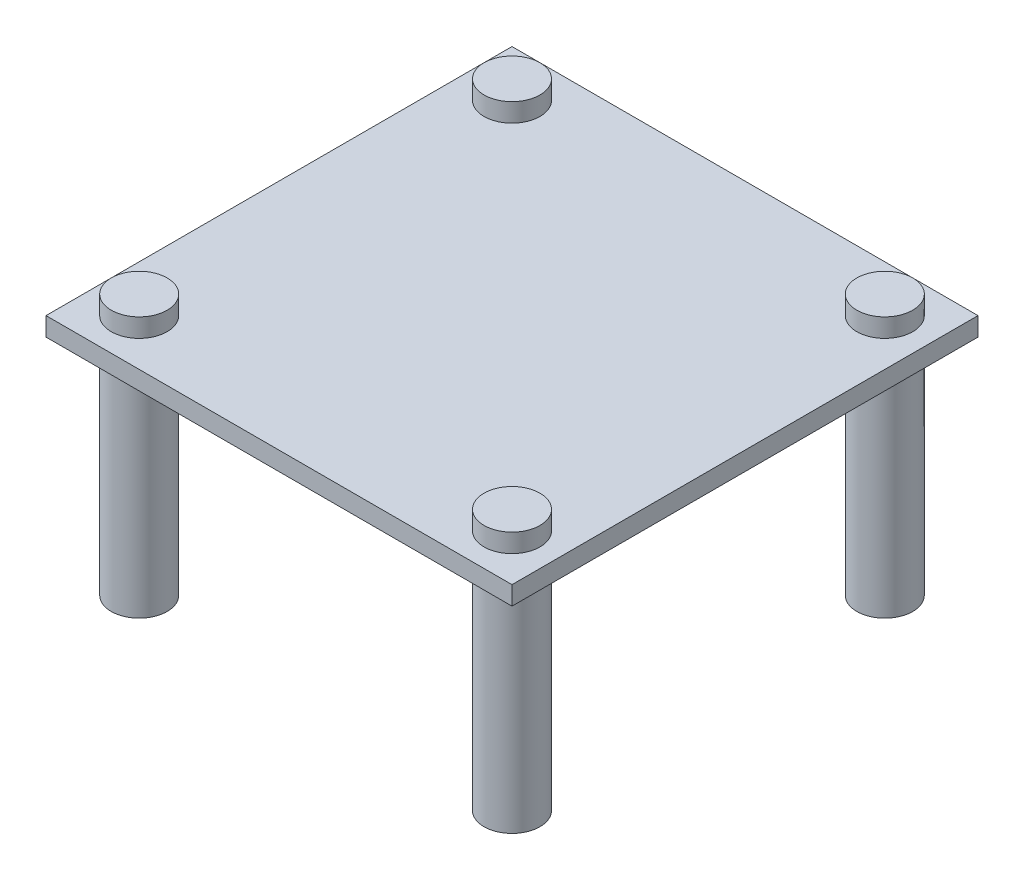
ISO-10303-21;
HEADER;
FILE_DESCRIPTION(('STEP AP214'),'2;1');
FILE_NAME('part.step','',(''),(''),'','','');
FILE_SCHEMA(('AUTOMOTIVE_DESIGN { 1 0 10303 214 1 1 1 1 }'));
ENDSEC;
DATA;
#1=APPLICATION_CONTEXT('core data for automotive mechanical design processes');
#2=APPLICATION_PROTOCOL_DEFINITION('international standard','automotive_design',2000,#1);
#3=PRODUCT_CONTEXT('',#1,'mechanical');
#4=PRODUCT('Part','Part','',(#3));
#5=PRODUCT_RELATED_PRODUCT_CATEGORY('part','',(#4));
#6=PRODUCT_DEFINITION_FORMATION('','',#4);
#7=PRODUCT_DEFINITION_CONTEXT('part definition',#1,'design');
#8=PRODUCT_DEFINITION('design','',#6,#7);
#9=PRODUCT_DEFINITION_SHAPE('','',#8);
#10=(LENGTH_UNIT() NAMED_UNIT(*) SI_UNIT(.MILLI.,.METRE.));
#11=(NAMED_UNIT(*) PLANE_ANGLE_UNIT() SI_UNIT($,.RADIAN.));
#12=(NAMED_UNIT(*) SI_UNIT($,.STERADIAN.) SOLID_ANGLE_UNIT());
#13=UNCERTAINTY_MEASURE_WITH_UNIT(LENGTH_MEASURE(1.E-05),#10,'distance_accuracy_value','');
#14=(GEOMETRIC_REPRESENTATION_CONTEXT(3) GLOBAL_UNCERTAINTY_ASSIGNED_CONTEXT((#13)) GLOBAL_UNIT_ASSIGNED_CONTEXT((#10,
#11,#12)) REPRESENTATION_CONTEXT('',''));
#15=CARTESIAN_POINT('',(0.,0.,0.));
#16=DIRECTION('',(0.,0.,1.));
#17=DIRECTION('',(1.,0.,0.));
#18=AXIS2_PLACEMENT_3D('',#15,#16,#17);
#19=CARTESIAN_POINT('',(0.,0.,0.));
#20=DIRECTION('',(0.,-1.,0.));
#21=DIRECTION('',(0.,0.,-1.));
#22=AXIS2_PLACEMENT_3D('',#19,#20,#21);
#23=PLANE('',#22);
#24=CARTESIAN_POINT('',(25.,0.,-25.));
#25=DIRECTION('',(0.,-1.,0.));
#26=DIRECTION('',(0.,0.,-1.));
#27=AXIS2_PLACEMENT_3D('',#24,#25,#26);
#28=CIRCLE('',#27,15.);
#29=CARTESIAN_POINT('',(25.,0.,-40.));
#30=VERTEX_POINT('',#29);
#31=EDGE_CURVE('E142',#30,#30,#28,.T.);
#32=ORIENTED_EDGE('',*,*,#31,.F.);
#33=EDGE_LOOP('',(#32));
#34=FACE_BOUND('',#33,.T.);
#35=CARTESIAN_POINT('',(25.,0.,-225.));
#36=DIRECTION('',(0.,-1.,0.));
#37=DIRECTION('',(0.,0.,-1.));
#38=AXIS2_PLACEMENT_3D('',#35,#36,#37);
#39=CIRCLE('',#38,15.);
#40=CARTESIAN_POINT('',(25.,0.,-240.));
#41=VERTEX_POINT('',#40);
#42=EDGE_CURVE('E154',#41,#41,#39,.T.);
#43=ORIENTED_EDGE('',*,*,#42,.F.);
#44=EDGE_LOOP('',(#43));
#45=FACE_BOUND('',#44,.T.);
#46=DIRECTION('',(0.,0.,1.));
#47=VECTOR('',#46,1.);
#48=CARTESIAN_POINT('',(0.,0.,0.));
#49=LINE('',#48,#47);
#50=CARTESIAN_POINT('',(0.,0.,-250.));
#51=VERTEX_POINT('',#50);
#52=CARTESIAN_POINT('',(0.,0.,0.));
#53=VERTEX_POINT('',#52);
#54=EDGE_CURVE('E105',#51,#53,#49,.T.);
#55=ORIENTED_EDGE('',*,*,#54,.F.);
#56=DIRECTION('',(-1.,0.,0.));
#57=VECTOR('',#56,1.);
#58=CARTESIAN_POINT('',(0.,0.,-250.));
#59=LINE('',#58,#57);
#60=CARTESIAN_POINT('',(250.,0.,-250.));
#61=VERTEX_POINT('',#60);
#62=EDGE_CURVE('E80',#61,#51,#59,.T.);
#63=ORIENTED_EDGE('',*,*,#62,.F.);
#64=DIRECTION('',(0.,0.,-1.));
#65=VECTOR('',#64,1.);
#66=CARTESIAN_POINT('',(250.,0.,0.));
#67=LINE('',#66,#65);
#68=CARTESIAN_POINT('',(250.,0.,0.));
#69=VERTEX_POINT('',#68);
#70=EDGE_CURVE('E74',#69,#61,#67,.T.);
#71=ORIENTED_EDGE('',*,*,#70,.F.);
#72=DIRECTION('',(1.,0.,0.));
#73=VECTOR('',#72,1.);
#74=CARTESIAN_POINT('',(0.,0.,0.));
#75=LINE('',#74,#73);
#76=EDGE_CURVE('E96',#53,#69,#75,.T.);
#77=ORIENTED_EDGE('',*,*,#76,.F.);
#78=EDGE_LOOP('',(#55,#63,#71,#77));
#79=FACE_BOUND('',#78,.T.);
#80=CARTESIAN_POINT('',(225.,0.,-225.));
#81=DIRECTION('',(0.,-1.,0.));
#82=DIRECTION('',(0.,0.,-1.));
#83=AXIS2_PLACEMENT_3D('',#80,#81,#82);
#84=CIRCLE('',#83,15.0000000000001);
#85=CARTESIAN_POINT('',(225.,0.,-240.));
#86=VERTEX_POINT('',#85);
#87=EDGE_CURVE('E148',#86,#86,#84,.T.);
#88=ORIENTED_EDGE('',*,*,#87,.F.);
#89=EDGE_LOOP('',(#88));
#90=FACE_BOUND('',#89,.T.);
#91=CARTESIAN_POINT('',(225.,0.,-25.));
#92=DIRECTION('',(0.,-1.,0.));
#93=DIRECTION('',(0.,0.,-1.));
#94=AXIS2_PLACEMENT_3D('',#91,#92,#93);
#95=CIRCLE('',#94,15.);
#96=CARTESIAN_POINT('',(225.,0.,-40.));
#97=VERTEX_POINT('',#96);
#98=EDGE_CURVE('E117',#97,#97,#95,.T.);
#99=ORIENTED_EDGE('',*,*,#98,.F.);
#100=EDGE_LOOP('',(#99));
#101=FACE_BOUND('',#100,.T.);
#102=ADVANCED_FACE('F38',(#34,#45,#79,#90,#101),#23,.T.);
#103=CARTESIAN_POINT('',(0.,10.,0.));
#104=DIRECTION('',(1.,0.,0.));
#105=DIRECTION('',(0.,0.,-1.));
#106=AXIS2_PLACEMENT_3D('',#103,#104,#105);
#107=PLANE('',#106);
#108=ORIENTED_EDGE('',*,*,#54,.T.);
#109=DIRECTION('',(0.,-1.,0.));
#110=VECTOR('',#109,1.);
#111=CARTESIAN_POINT('',(0.,10.,0.));
#112=LINE('',#111,#110);
#113=CARTESIAN_POINT('',(0.,10.,0.));
#114=VERTEX_POINT('',#113);
#115=EDGE_CURVE('E11',#114,#53,#112,.T.);
#116=ORIENTED_EDGE('',*,*,#115,.F.);
#117=DIRECTION('',(0.,0.,1.));
#118=VECTOR('',#117,1.);
#119=CARTESIAN_POINT('',(0.,10.,0.));
#120=LINE('',#119,#118);
#121=CARTESIAN_POINT('',(0.,10.,-250.));
#122=VERTEX_POINT('',#121);
#123=EDGE_CURVE('E92',#122,#114,#120,.T.);
#124=ORIENTED_EDGE('',*,*,#123,.F.);
#125=DIRECTION('',(0.,-1.,0.));
#126=VECTOR('',#125,1.);
#127=CARTESIAN_POINT('',(0.,10.,-250.));
#128=LINE('',#127,#126);
#129=EDGE_CURVE('E101',#122,#51,#128,.T.);
#130=ORIENTED_EDGE('',*,*,#129,.T.);
#131=EDGE_LOOP('',(#108,#116,#124,#130));
#132=FACE_BOUND('',#131,.T.);
#133=ADVANCED_FACE('F40',(#132),#107,.F.);
#134=CARTESIAN_POINT('',(0.,10.,0.));
#135=DIRECTION('',(0.,0.,-1.));
#136=DIRECTION('',(-1.,0.,0.));
#137=AXIS2_PLACEMENT_3D('',#134,#135,#136);
#138=PLANE('',#137);
#139=ORIENTED_EDGE('',*,*,#76,.T.);
#140=DIRECTION('',(0.,-1.,0.));
#141=VECTOR('',#140,1.);
#142=CARTESIAN_POINT('',(250.,10.,0.));
#143=LINE('',#142,#141);
#144=CARTESIAN_POINT('',(250.,10.,0.));
#145=VERTEX_POINT('',#144);
#146=EDGE_CURVE('E48',#145,#69,#143,.T.);
#147=ORIENTED_EDGE('',*,*,#146,.F.);
#148=DIRECTION('',(1.,0.,0.));
#149=VECTOR('',#148,1.);
#150=CARTESIAN_POINT('',(0.,10.,0.));
#151=LINE('',#150,#149);
#152=EDGE_CURVE('E87',#114,#145,#151,.T.);
#153=ORIENTED_EDGE('',*,*,#152,.F.);
#154=ORIENTED_EDGE('',*,*,#115,.T.);
#155=EDGE_LOOP('',(#139,#147,#153,#154));
#156=FACE_BOUND('',#155,.T.);
#157=ADVANCED_FACE('F95',(#156),#138,.F.);
#158=CARTESIAN_POINT('',(250.,10.,0.));
#159=DIRECTION('',(-1.,0.,0.));
#160=DIRECTION('',(0.,0.,1.));
#161=AXIS2_PLACEMENT_3D('',#158,#159,#160);
#162=PLANE('',#161);
#163=ORIENTED_EDGE('',*,*,#70,.T.);
#164=DIRECTION('',(0.,-1.,0.));
#165=VECTOR('',#164,1.);
#166=CARTESIAN_POINT('',(250.,10.,-250.));
#167=LINE('',#166,#165);
#168=CARTESIAN_POINT('',(250.,10.,-250.));
#169=VERTEX_POINT('',#168);
#170=EDGE_CURVE('E97',#169,#61,#167,.T.);
#171=ORIENTED_EDGE('',*,*,#170,.F.);
#172=DIRECTION('',(0.,0.,-1.));
#173=VECTOR('',#172,1.);
#174=CARTESIAN_POINT('',(250.,10.,0.));
#175=LINE('',#174,#173);
#176=EDGE_CURVE('E90',#145,#169,#175,.T.);
#177=ORIENTED_EDGE('',*,*,#176,.F.);
#178=ORIENTED_EDGE('',*,*,#146,.T.);
#179=EDGE_LOOP('',(#163,#171,#177,#178));
#180=FACE_BOUND('',#179,.T.);
#181=ADVANCED_FACE('F99',(#180),#162,.F.);
#182=CARTESIAN_POINT('',(0.,10.,-250.));
#183=DIRECTION('',(0.,0.,1.));
#184=DIRECTION('',(1.,0.,0.));
#185=AXIS2_PLACEMENT_3D('',#182,#183,#184);
#186=PLANE('',#185);
#187=ORIENTED_EDGE('',*,*,#62,.T.);
#188=ORIENTED_EDGE('',*,*,#129,.F.);
#189=DIRECTION('',(-1.,0.,0.));
#190=VECTOR('',#189,1.);
#191=CARTESIAN_POINT('',(0.,10.,-250.));
#192=LINE('',#191,#190);
#193=EDGE_CURVE('E57',#169,#122,#192,.T.);
#194=ORIENTED_EDGE('',*,*,#193,.F.);
#195=ORIENTED_EDGE('',*,*,#170,.T.);
#196=EDGE_LOOP('',(#187,#188,#194,#195));
#197=FACE_BOUND('',#196,.T.);
#198=ADVANCED_FACE('F212',(#197),#186,.F.);
#199=CARTESIAN_POINT('',(0.,10.,0.));
#200=DIRECTION('',(0.,-1.,0.));
#201=DIRECTION('',(0.,0.,-1.));
#202=AXIS2_PLACEMENT_3D('',#199,#200,#201);
#203=PLANE('',#202);
#204=CARTESIAN_POINT('',(225.,10.,-25.));
#205=DIRECTION('',(0.,-1.,0.));
#206=DIRECTION('',(0.,0.,-1.));
#207=AXIS2_PLACEMENT_3D('',#204,#205,#206);
#208=CIRCLE('',#207,15.);
#209=CARTESIAN_POINT('',(225.,10.,-40.));
#210=VERTEX_POINT('',#209);
#211=EDGE_CURVE('E42',#210,#210,#208,.T.);
#212=ORIENTED_EDGE('',*,*,#211,.T.);
#213=EDGE_LOOP('',(#212));
#214=FACE_BOUND('',#213,.T.);
#215=CARTESIAN_POINT('',(25.,10.,-25.));
#216=DIRECTION('',(0.,-1.,0.));
#217=DIRECTION('',(0.,0.,-1.));
#218=AXIS2_PLACEMENT_3D('',#215,#216,#217);
#219=CIRCLE('',#218,15.);
#220=CARTESIAN_POINT('',(25.,10.,-40.));
#221=VERTEX_POINT('',#220);
#222=EDGE_CURVE('E122',#221,#221,#219,.T.);
#223=ORIENTED_EDGE('',*,*,#222,.T.);
#224=EDGE_LOOP('',(#223));
#225=FACE_BOUND('',#224,.T.);
#226=CARTESIAN_POINT('',(225.,10.,-225.));
#227=DIRECTION('',(0.,-1.,0.));
#228=DIRECTION('',(0.,0.,-1.));
#229=AXIS2_PLACEMENT_3D('',#226,#227,#228);
#230=CIRCLE('',#229,15.0000000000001);
#231=CARTESIAN_POINT('',(225.,10.,-240.));
#232=VERTEX_POINT('',#231);
#233=EDGE_CURVE('E119',#232,#232,#230,.T.);
#234=ORIENTED_EDGE('',*,*,#233,.T.);
#235=EDGE_LOOP('',(#234));
#236=FACE_BOUND('',#235,.T.);
#237=CARTESIAN_POINT('',(25.,10.,-225.));
#238=DIRECTION('',(0.,-1.,0.));
#239=DIRECTION('',(0.,0.,-1.));
#240=AXIS2_PLACEMENT_3D('',#237,#238,#239);
#241=CIRCLE('',#240,15.);
#242=CARTESIAN_POINT('',(25.,10.,-240.));
#243=VERTEX_POINT('',#242);
#244=EDGE_CURVE('E114',#243,#243,#241,.T.);
#245=ORIENTED_EDGE('',*,*,#244,.T.);
#246=EDGE_LOOP('',(#245));
#247=FACE_BOUND('',#246,.T.);
#248=ORIENTED_EDGE('',*,*,#123,.T.);
#249=ORIENTED_EDGE('',*,*,#152,.T.);
#250=ORIENTED_EDGE('',*,*,#176,.T.);
#251=ORIENTED_EDGE('',*,*,#193,.T.);
#252=EDGE_LOOP('',(#248,#249,#250,#251));
#253=FACE_BOUND('',#252,.T.);
#254=ADVANCED_FACE('F88',(#214,#225,#236,#247,#253),#203,.F.);
#255=CARTESIAN_POINT('',(25.,-120.,-225.));
#256=DIRECTION('',(0.,1.,0.));
#257=DIRECTION('',(0.,0.,1.));
#258=AXIS2_PLACEMENT_3D('',#255,#256,#257);
#259=CYLINDRICAL_SURFACE('',#258,15.);
#260=CARTESIAN_POINT('',(25.,-120.,-225.));
#261=DIRECTION('',(0.,-1.,0.));
#262=DIRECTION('',(0.,0.,-1.));
#263=AXIS2_PLACEMENT_3D('',#260,#261,#262);
#264=CIRCLE('',#263,15.);
#265=CARTESIAN_POINT('',(25.,-120.,-240.));
#266=VERTEX_POINT('',#265);
#267=EDGE_CURVE('E108',#266,#266,#264,.T.);
#268=ORIENTED_EDGE('',*,*,#267,.F.);
#269=EDGE_LOOP('',(#268));
#270=FACE_BOUND('',#269,.T.);
#271=ORIENTED_EDGE('',*,*,#42,.T.);
#272=EDGE_LOOP('',(#271));
#273=FACE_BOUND('',#272,.T.);
#274=ADVANCED_FACE('F162',(#270,#273),#259,.T.);
#275=CARTESIAN_POINT('',(25.,-120.,-225.));
#276=DIRECTION('',(0.,-1.,0.));
#277=DIRECTION('',(0.,0.,-1.));
#278=AXIS2_PLACEMENT_3D('',#275,#276,#277);
#279=PLANE('',#278);
#280=ORIENTED_EDGE('',*,*,#267,.T.);
#281=EDGE_LOOP('',(#280));
#282=FACE_BOUND('',#281,.T.);
#283=ADVANCED_FACE('F203',(#282),#279,.T.);
#284=CARTESIAN_POINT('',(225.,-120.,-225.));
#285=DIRECTION('',(0.,1.,0.));
#286=DIRECTION('',(0.,0.,1.));
#287=AXIS2_PLACEMENT_3D('',#284,#285,#286);
#288=CYLINDRICAL_SURFACE('',#287,15.0000000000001);
#289=CARTESIAN_POINT('',(225.,-120.,-225.));
#290=DIRECTION('',(0.,-1.,0.));
#291=DIRECTION('',(0.,0.,-1.));
#292=AXIS2_PLACEMENT_3D('',#289,#290,#291);
#293=CIRCLE('',#292,15.0000000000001);
#294=CARTESIAN_POINT('',(225.,-120.,-240.));
#295=VERTEX_POINT('',#294);
#296=EDGE_CURVE('E151',#295,#295,#293,.T.);
#297=ORIENTED_EDGE('',*,*,#296,.F.);
#298=EDGE_LOOP('',(#297));
#299=FACE_BOUND('',#298,.T.);
#300=ORIENTED_EDGE('',*,*,#87,.T.);
#301=EDGE_LOOP('',(#300));
#302=FACE_BOUND('',#301,.T.);
#303=ADVANCED_FACE('F199',(#299,#302),#288,.T.);
#304=CARTESIAN_POINT('',(225.,-120.,-225.));
#305=DIRECTION('',(0.,-1.,0.));
#306=DIRECTION('',(0.,0.,-1.));
#307=AXIS2_PLACEMENT_3D('',#304,#305,#306);
#308=PLANE('',#307);
#309=ORIENTED_EDGE('',*,*,#296,.T.);
#310=EDGE_LOOP('',(#309));
#311=FACE_BOUND('',#310,.T.);
#312=ADVANCED_FACE('F195',(#311),#308,.T.);
#313=CARTESIAN_POINT('',(25.,-120.,-25.));
#314=DIRECTION('',(0.,1.,0.));
#315=DIRECTION('',(0.,0.,1.));
#316=AXIS2_PLACEMENT_3D('',#313,#314,#315);
#317=CYLINDRICAL_SURFACE('',#316,15.);
#318=CARTESIAN_POINT('',(25.,-120.,-25.));
#319=DIRECTION('',(0.,-1.,0.));
#320=DIRECTION('',(0.,0.,-1.));
#321=AXIS2_PLACEMENT_3D('',#318,#319,#320);
#322=CIRCLE('',#321,15.);
#323=CARTESIAN_POINT('',(25.,-120.,-40.));
#324=VERTEX_POINT('',#323);
#325=EDGE_CURVE('E145',#324,#324,#322,.T.);
#326=ORIENTED_EDGE('',*,*,#325,.F.);
#327=EDGE_LOOP('',(#326));
#328=FACE_BOUND('',#327,.T.);
#329=ORIENTED_EDGE('',*,*,#31,.T.);
#330=EDGE_LOOP('',(#329));
#331=FACE_BOUND('',#330,.T.);
#332=ADVANCED_FACE('F187',(#328,#331),#317,.T.);
#333=CARTESIAN_POINT('',(25.,-120.,-25.));
#334=DIRECTION('',(0.,-1.,0.));
#335=DIRECTION('',(0.,0.,-1.));
#336=AXIS2_PLACEMENT_3D('',#333,#334,#335);
#337=PLANE('',#336);
#338=ORIENTED_EDGE('',*,*,#325,.T.);
#339=EDGE_LOOP('',(#338));
#340=FACE_BOUND('',#339,.T.);
#341=ADVANCED_FACE('F177',(#340),#337,.T.);
#342=CARTESIAN_POINT('',(225.,-120.,-25.));
#343=DIRECTION('',(0.,1.,0.));
#344=DIRECTION('',(0.,0.,1.));
#345=AXIS2_PLACEMENT_3D('',#342,#343,#344);
#346=CYLINDRICAL_SURFACE('',#345,15.);
#347=CARTESIAN_POINT('',(225.,-120.,-25.));
#348=DIRECTION('',(0.,-1.,0.));
#349=DIRECTION('',(0.,0.,-1.));
#350=AXIS2_PLACEMENT_3D('',#347,#348,#349);
#351=CIRCLE('',#350,15.);
#352=CARTESIAN_POINT('',(225.,-120.,-40.));
#353=VERTEX_POINT('',#352);
#354=EDGE_CURVE('E139',#353,#353,#351,.T.);
#355=ORIENTED_EDGE('',*,*,#354,.F.);
#356=EDGE_LOOP('',(#355));
#357=FACE_BOUND('',#356,.T.);
#358=ORIENTED_EDGE('',*,*,#98,.T.);
#359=EDGE_LOOP('',(#358));
#360=FACE_BOUND('',#359,.T.);
#361=ADVANCED_FACE('F174',(#357,#360),#346,.T.);
#362=CARTESIAN_POINT('',(225.,-120.,-25.));
#363=DIRECTION('',(0.,-1.,0.));
#364=DIRECTION('',(0.,0.,-1.));
#365=AXIS2_PLACEMENT_3D('',#362,#363,#364);
#366=PLANE('',#365);
#367=ORIENTED_EDGE('',*,*,#354,.T.);
#368=EDGE_LOOP('',(#367));
#369=FACE_BOUND('',#368,.T.);
#370=ADVANCED_FACE('F176',(#369),#366,.T.);
#371=CARTESIAN_POINT('',(25.,20.,-225.));
#372=DIRECTION('',(0.,-1.,0.));
#373=DIRECTION('',(0.,0.,-1.));
#374=AXIS2_PLACEMENT_3D('',#371,#372,#373);
#375=CYLINDRICAL_SURFACE('',#374,15.);
#376=CARTESIAN_POINT('',(25.,20.,-225.));
#377=DIRECTION('',(0.,-1.,0.));
#378=DIRECTION('',(0.,0.,-1.));
#379=AXIS2_PLACEMENT_3D('',#376,#377,#378);
#380=CIRCLE('',#379,15.);
#381=CARTESIAN_POINT('',(25.,20.,-240.));
#382=VERTEX_POINT('',#381);
#383=EDGE_CURVE('E118',#382,#382,#380,.T.);
#384=ORIENTED_EDGE('',*,*,#383,.T.);
#385=EDGE_LOOP('',(#384));
#386=FACE_BOUND('',#385,.T.);
#387=ORIENTED_EDGE('',*,*,#244,.F.);
#388=EDGE_LOOP('',(#387));
#389=FACE_BOUND('',#388,.T.);
#390=ADVANCED_FACE('F184',(#386,#389),#375,.T.);
#391=CARTESIAN_POINT('',(25.,20.,-225.));
#392=DIRECTION('',(0.,-1.,0.));
#393=DIRECTION('',(0.,0.,-1.));
#394=AXIS2_PLACEMENT_3D('',#391,#392,#393);
#395=PLANE('',#394);
#396=ORIENTED_EDGE('',*,*,#383,.F.);
#397=EDGE_LOOP('',(#396));
#398=FACE_BOUND('',#397,.T.);
#399=ADVANCED_FACE('F297',(#398),#395,.F.);
#400=CARTESIAN_POINT('',(225.,20.,-225.));
#401=DIRECTION('',(0.,-1.,0.));
#402=DIRECTION('',(0.,0.,-1.));
#403=AXIS2_PLACEMENT_3D('',#400,#401,#402);
#404=CYLINDRICAL_SURFACE('',#403,15.0000000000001);
#405=CARTESIAN_POINT('',(225.,20.,-225.));
#406=DIRECTION('',(0.,-1.,0.));
#407=DIRECTION('',(0.,0.,-1.));
#408=AXIS2_PLACEMENT_3D('',#405,#406,#407);
#409=CIRCLE('',#408,15.0000000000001);
#410=CARTESIAN_POINT('',(225.,20.,-240.));
#411=VERTEX_POINT('',#410);
#412=EDGE_CURVE('E121',#411,#411,#409,.T.);
#413=ORIENTED_EDGE('',*,*,#412,.T.);
#414=EDGE_LOOP('',(#413));
#415=FACE_BOUND('',#414,.T.);
#416=ORIENTED_EDGE('',*,*,#233,.F.);
#417=EDGE_LOOP('',(#416));
#418=FACE_BOUND('',#417,.T.);
#419=ADVANCED_FACE('F306',(#415,#418),#404,.T.);
#420=CARTESIAN_POINT('',(225.,20.,-225.));
#421=DIRECTION('',(0.,-1.,0.));
#422=DIRECTION('',(0.,0.,-1.));
#423=AXIS2_PLACEMENT_3D('',#420,#421,#422);
#424=PLANE('',#423);
#425=ORIENTED_EDGE('',*,*,#412,.F.);
#426=EDGE_LOOP('',(#425));
#427=FACE_BOUND('',#426,.T.);
#428=ADVANCED_FACE('F316',(#427),#424,.F.);
#429=CARTESIAN_POINT('',(25.,20.,-25.));
#430=DIRECTION('',(0.,-1.,0.));
#431=DIRECTION('',(0.,0.,-1.));
#432=AXIS2_PLACEMENT_3D('',#429,#430,#431);
#433=CYLINDRICAL_SURFACE('',#432,15.);
#434=CARTESIAN_POINT('',(25.,20.,-25.));
#435=DIRECTION('',(0.,-1.,0.));
#436=DIRECTION('',(0.,0.,-1.));
#437=AXIS2_PLACEMENT_3D('',#434,#435,#436);
#438=CIRCLE('',#437,15.);
#439=CARTESIAN_POINT('',(25.,20.,-40.));
#440=VERTEX_POINT('',#439);
#441=EDGE_CURVE('E124',#440,#440,#438,.T.);
#442=ORIENTED_EDGE('',*,*,#441,.T.);
#443=EDGE_LOOP('',(#442));
#444=FACE_BOUND('',#443,.T.);
#445=ORIENTED_EDGE('',*,*,#222,.F.);
#446=EDGE_LOOP('',(#445));
#447=FACE_BOUND('',#446,.T.);
#448=ADVANCED_FACE('F326',(#444,#447),#433,.T.);
#449=CARTESIAN_POINT('',(25.,20.,-25.));
#450=DIRECTION('',(0.,-1.,0.));
#451=DIRECTION('',(0.,0.,-1.));
#452=AXIS2_PLACEMENT_3D('',#449,#450,#451);
#453=PLANE('',#452);
#454=ORIENTED_EDGE('',*,*,#441,.F.);
#455=EDGE_LOOP('',(#454));
#456=FACE_BOUND('',#455,.T.);
#457=ADVANCED_FACE('F336',(#456),#453,.F.);
#458=CARTESIAN_POINT('',(225.,20.,-25.));
#459=DIRECTION('',(0.,-1.,0.));
#460=DIRECTION('',(0.,0.,-1.));
#461=AXIS2_PLACEMENT_3D('',#458,#459,#460);
#462=CYLINDRICAL_SURFACE('',#461,15.);
#463=CARTESIAN_POINT('',(225.,20.,-25.));
#464=DIRECTION('',(0.,-1.,0.));
#465=DIRECTION('',(0.,0.,-1.));
#466=AXIS2_PLACEMENT_3D('',#463,#464,#465);
#467=CIRCLE('',#466,15.);
#468=CARTESIAN_POINT('',(225.,20.,-40.));
#469=VERTEX_POINT('',#468);
#470=EDGE_CURVE('E134',#469,#469,#467,.T.);
#471=ORIENTED_EDGE('',*,*,#470,.T.);
#472=EDGE_LOOP('',(#471));
#473=FACE_BOUND('',#472,.T.);
#474=ORIENTED_EDGE('',*,*,#211,.F.);
#475=EDGE_LOOP('',(#474));
#476=FACE_BOUND('',#475,.T.);
#477=ADVANCED_FACE('F345',(#473,#476),#462,.T.);
#478=CARTESIAN_POINT('',(225.,20.,-25.));
#479=DIRECTION('',(0.,-1.,0.));
#480=DIRECTION('',(0.,0.,-1.));
#481=AXIS2_PLACEMENT_3D('',#478,#479,#480);
#482=PLANE('',#481);
#483=ORIENTED_EDGE('',*,*,#470,.F.);
#484=EDGE_LOOP('',(#483));
#485=FACE_BOUND('',#484,.T.);
#486=ADVANCED_FACE('F355',(#485),#482,.F.);
#487=CLOSED_SHELL('',(#102,#133,#157,#181,#198,#254,#274,#283,#303,#312,#332,#341,#361,#370,
#390,#399,#419,#428,#448,#457,#477,#486));
#488=MANIFOLD_SOLID_BREP('B2',#487);
#489=ADVANCED_BREP_SHAPE_REPRESENTATION('',(#18,#488),#14);
#490=SHAPE_DEFINITION_REPRESENTATION(#9,#489);
ENDSEC;
END-ISO-10303-21;
